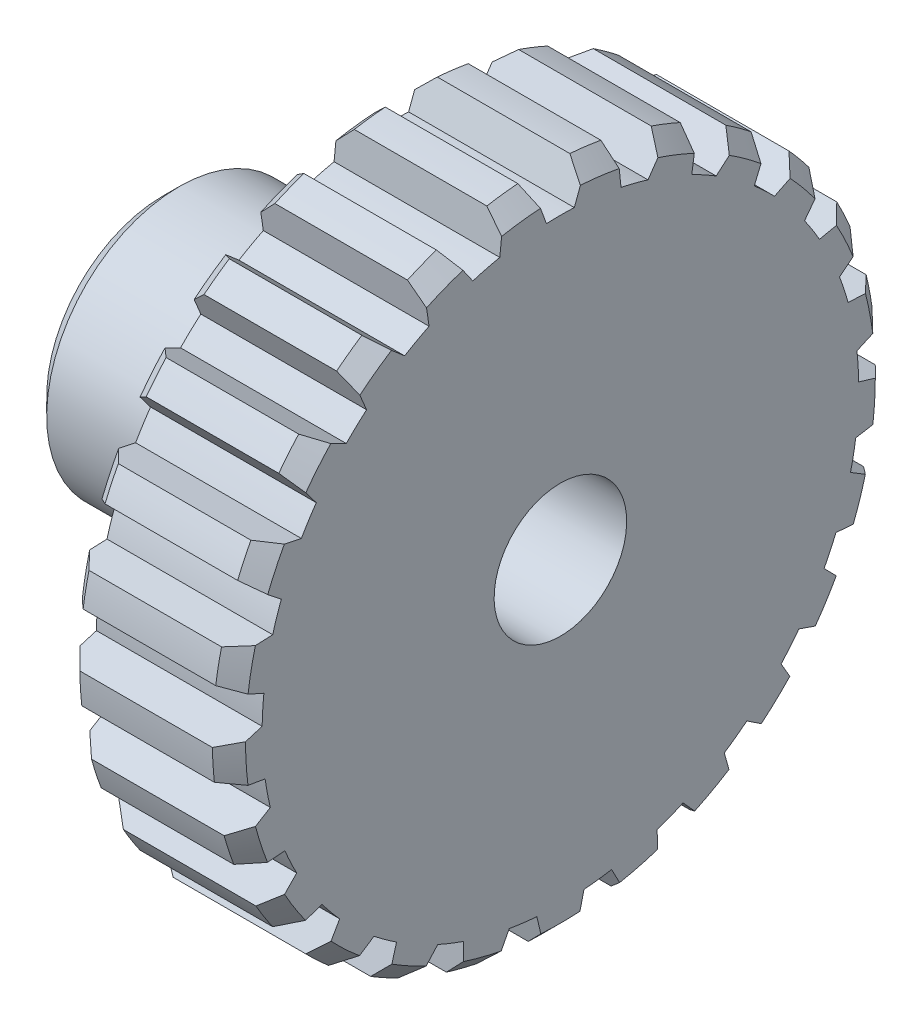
from build123d import *

# Parameters (mm, degrees)
CHAMFER4_SIZE      = 0.5
CUT_EXTRUDE2_DEPTH = 10
SCALE3_SCALE       = 1.25


with BuildPart() as part:
    # Sketch1 → Revolve1 (revolve)
    with BuildSketch(Plane.XY):
        Polygon((0, 2), (-12, 2), (-12, 4), (-5, 4), (-5, 10), (0, 10), align=None)
    revolve(axis=Axis((0, 0, 0), (-1, 0, 0)))

    # Chamfer4
    chamfer4_edges = [part.edges().sort_by_distance(p)[0] for p in [
        (-12, -4, 0),
        (-5, -10, 0),
        (0, -10, 0),
    ]]
    chamfer(chamfer4_edges, length=CHAMFER4_SIZE)

    # Sketch3 → Cut-Extrude2 (cut)
    with BuildSketch(Plane(origin=(0, 0, 0), x_dir=(0, 0, -1), z_dir=(1, 0, 0))):
        with BuildLine():
            Line((-0.785, 9.969141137), (-0.42, 8.990194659))
            ThreePointArc((-0.42, 8.990194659), (0, 9), (0.42, 8.990194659))
            Line((0.42, 8.990194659), (0.785, 9.969141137))
            Line((0.785, 9.969141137), (0.785, 10.77942288))
            ThreePointArc((0.785, 10.77942288), (0, 10.807968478), (-0.785, 10.77942288))
            Line((-0.785, 10.77942288), (-0.785, 9.969141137))
        make_face()
        with BuildLine():
            Line((1.920395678, 10.63598905), (1.718886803, 9.851163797))
            Line((1.718886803, 9.851163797), (1.828965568, 8.812200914))
            ThreePointArc((1.828965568, 8.812200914), (2.238208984, 8.71724845), (2.642575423, 8.603301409))
            Line((2.642575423, 8.603301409), (3.239562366, 9.460720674))
            Line((3.239562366, 9.460720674), (3.441071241, 10.245545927))
            ThreePointArc((3.441071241, 10.245545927), (2.687832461, 10.468416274), (1.920395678, 10.63598905))
        make_face()
        with BuildLine():
            Line((4.505125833, 9.824256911), (4.114769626, 9.114201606))
            Line((4.114769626, 9.114201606), (3.963010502, 8.080504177))
            ThreePointArc((3.963010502, 8.080504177), (4.335783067, 7.88676012), (4.699108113, 7.675831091))
            Line((4.699108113, 7.675831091), (5.490571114, 8.357848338))
            Line((5.490571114, 8.357848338), (5.880927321, 9.067903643))
            ThreePointArc((5.880927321, 9.067903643), (5.206778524, 9.471094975), (4.505125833, 9.824256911))
        make_face()
        with BuildLine():
            Line((6.806782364, 8.39523058), (6.252106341, 7.804560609))
            Line((6.252106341, 7.804560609), (5.848044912, 6.841079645))
            ThreePointArc((5.848044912, 6.841079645), (6.160923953, 6.560717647), (6.460378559, 6.266060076))
            Line((6.460378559, 6.266060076), (7.396587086, 6.729821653))
            Line((7.396587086, 6.729821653), (7.951263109, 7.320491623))
            ThreePointArc((7.951263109, 7.320491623), (7.398563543, 7.878669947), (6.806782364, 8.39523058))
        make_face()
        with BuildLine():
            Line((8.680743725, 6.438701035), (7.996600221, 6.004530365))
            Line((7.996600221, 6.004530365), (7.365625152, 5.171804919))
            ThreePointArc((7.365625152, 5.171804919), (7.59895133, 4.822441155), (7.81571966, 4.462569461))
            Line((7.81571966, 4.462569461), (8.837848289, 4.678935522))
            Line((8.837848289, 4.678935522), (9.521991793, 5.113106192))
            ThreePointArc((9.521991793, 5.113106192), (9.125469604, 5.79119911), (8.680743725, 6.438701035))
        make_face()
        with BuildLine():
            Line((10.009262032, 4.077604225), (9.238638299, 3.827213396))
            Line((9.238638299, 3.827213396), (8.420396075, 3.177566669))
            ThreePointArc((8.420396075, 3.177566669), (8.559508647, 2.781152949), (8.67997035, 2.378679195))
            Line((8.67997035, 2.378679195), (9.72379498, 2.334054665))
            Line((9.72379498, 2.334054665), (10.494418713, 2.584445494))
            ThreePointArc((10.494418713, 2.584445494), (10.278988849, 3.339845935), (10.009262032, 4.077604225))
        make_face()
        with BuildLine():
            Line((10.708861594, 1.460296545), (9.900178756, 1.409418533))
            Line((9.900178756, 1.409418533), (8.946082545, 0.983670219))
            ThreePointArc((8.946082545, 0.983670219), (8.982240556, 0.565114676), (8.998826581, 0.145327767))
            Line((8.998826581, 0.145327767), (9.998759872, -0.157483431))
            Line((9.998759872, -0.157483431), (10.807442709, -0.106605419))
            ThreePointArc((10.807442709, -0.106605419), (10.786641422, 0.678637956), (10.708861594, 1.460296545))
        make_face()
        with BuildLine():
            Line((10.735583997, -1.248766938), (9.939654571, -1.09693528))
            Line((9.939654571, -1.09693528), (8.909653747, -1.272033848))
            ThreePointArc((8.909653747, -1.272033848), (8.840585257, -1.686431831), (8.752253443, -2.097155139))
            Line((8.752253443, -2.097155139), (9.645465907, -2.639126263))
            Line((9.645465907, -2.639126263), (10.441395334, -2.790957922))
            ThreePointArc((10.441395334, -2.790957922), (10.616529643, -2.025211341), (10.735583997, -1.248766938))
        make_face()
        with BuildLine():
            Line((10.087750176, -3.879365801), (9.354585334, -3.534364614))
            Line((9.354585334, -3.534364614), (8.313398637, -3.447811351))
            ThreePointArc((8.313398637, -3.447811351), (8.143443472, -3.832013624), (7.955744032, -4.207866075))
            Line((7.955744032, -4.207866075), (8.686111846, -4.954943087))
            Line((8.686111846, -4.954943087), (9.419276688, -5.299944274))
            ThreePointArc((9.419276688, -5.299944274), (9.779342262, -4.601809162), (10.087750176, -3.879365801))
        make_face()
        with BuildLine():
            Line((8.806065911, -6.266209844), (8.181733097, -5.749716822))
            Line((8.181733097, -5.749716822), (7.194782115, -5.406950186))
            ThreePointArc((7.194782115, -5.406950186), (6.934619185, -5.736815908), (6.659345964, -6.05418131))
            Line((6.659345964, -6.05418131), (7.180977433, -6.959422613))
            Line((7.180977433, -6.959422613), (7.805310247, -7.475915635))
            ThreePointArc((7.805310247, -7.475915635), (8.32768284, -6.889258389), (8.806065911, -6.266209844))
        make_face()
        with BuildLine():
            Line((6.971064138, -8.259324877), (6.494792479, -7.603793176))
            Line((6.494792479, -7.603793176), (5.624090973, -7.026350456))
            ThreePointArc((5.624090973, -7.026350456), (5.290067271, -7.281152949), (4.944516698, -7.520090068))
            Line((4.944516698, -7.520090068), (5.224635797, -8.526616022))
            Line((5.224635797, -8.526616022), (5.700907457, -9.182147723))
            ThreePointArc((5.700907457, -9.182147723), (6.352764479, -8.743830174), (6.971064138, -8.259324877))
        make_face()
        with BuildLine():
            Line((4.698044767, -9.733476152), (4.399760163, -8.980095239))
            Line((4.399760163, -8.980095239), (3.700017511, -8.204259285))
            ThreePointArc((3.700017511, -8.204259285), (3.313120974, -8.367988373), (2.919005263, -8.513483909))
            Line((2.919005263, -8.513483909), (2.94001108, -9.558050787))
            Line((2.94001108, -9.558050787), (3.238295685, -10.311431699))
            ThreePointArc((3.238295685, -10.311431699), (3.978678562, -10.048994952), (4.698044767, -9.733476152))
        make_face()
        with BuildLine():
            Line((2.129829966, -10.596037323), (2.028274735, -9.792144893))
            Line((2.028274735, -9.792144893), (1.543458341, -8.86666433))
            ThreePointArc((1.543458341, -8.86666433), (1.127999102, -8.929032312), (0.710081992, -8.971944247))
            Line((0.710081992, -8.971944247), (0.470654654, -9.988918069))
            Line((0.470654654, -9.988918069), (0.572209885, -10.7928105))
            ThreePointArc((0.572209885, -10.7928105), (1.354597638, -10.722744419), (2.129829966, -10.596037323))
        make_face()
        with BuildLine():
            Line((-0.572209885, -10.7928105), (-0.470654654, -9.988918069))
            Line((-0.470654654, -9.988918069), (-0.710081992, -8.971944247))
            ThreePointArc((-0.710081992, -8.971944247), (-1.127999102, -8.929032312), (-1.543458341, -8.86666433))
            Line((-1.543458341, -8.86666433), (-2.028274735, -9.792144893))
            Line((-2.028274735, -9.792144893), (-2.129829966, -10.596037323))
            ThreePointArc((-2.129829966, -10.596037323), (-1.354597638, -10.722744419), (-0.572209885, -10.7928105))
        make_face()
        with BuildLine():
            Line((-3.238295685, -10.311431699), (-2.94001108, -9.558050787))
            Line((-2.94001108, -9.558050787), (-2.919005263, -8.513483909))
            ThreePointArc((-2.919005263, -8.513483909), (-3.313120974, -8.367988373), (-3.700017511, -8.204259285))
            Line((-3.700017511, -8.204259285), (-4.399760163, -8.980095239))
            Line((-4.399760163, -8.980095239), (-4.698044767, -9.733476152))
            ThreePointArc((-4.698044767, -9.733476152), (-3.978678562, -10.048994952), (-3.238295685, -10.311431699))
        make_face()
        with BuildLine():
            Line((-5.700907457, -9.182147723), (-5.224635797, -8.526616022))
            Line((-5.224635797, -8.526616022), (-4.944516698, -7.520090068))
            ThreePointArc((-4.944516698, -7.520090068), (-5.290067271, -7.281152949), (-5.624090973, -7.026350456))
            Line((-5.624090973, -7.026350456), (-6.494792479, -7.603793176))
            Line((-6.494792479, -7.603793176), (-6.971064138, -8.259324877))
            ThreePointArc((-6.971064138, -8.259324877), (-6.352764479, -8.743830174), (-5.700907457, -9.182147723))
        make_face()
        with BuildLine():
            Line((-7.805310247, -7.475915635), (-7.180977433, -6.959422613))
            Line((-7.180977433, -6.959422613), (-6.659345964, -6.05418131))
            ThreePointArc((-6.659345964, -6.05418131), (-6.934619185, -5.736815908), (-7.194782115, -5.406950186))
            Line((-7.194782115, -5.406950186), (-8.181733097, -5.749716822))
            Line((-8.181733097, -5.749716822), (-8.806065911, -6.266209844))
            ThreePointArc((-8.806065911, -6.266209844), (-8.32768284, -6.889258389), (-7.805310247, -7.475915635))
        make_face()
        with BuildLine():
            Line((-9.419276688, -5.299944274), (-8.686111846, -4.954943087))
            Line((-8.686111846, -4.954943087), (-7.955744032, -4.207866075))
            ThreePointArc((-7.955744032, -4.207866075), (-8.143443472, -3.832013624), (-8.313398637, -3.447811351))
            Line((-8.313398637, -3.447811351), (-9.354585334, -3.534364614))
            Line((-9.354585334, -3.534364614), (-10.087750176, -3.879365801))
            ThreePointArc((-10.087750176, -3.879365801), (-9.779342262, -4.601809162), (-9.419276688, -5.299944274))
        make_face()
        with BuildLine():
            Line((-10.441395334, -2.790957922), (-9.645465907, -2.639126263))
            Line((-9.645465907, -2.639126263), (-8.752253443, -2.097155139))
            ThreePointArc((-8.752253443, -2.097155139), (-8.840585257, -1.686431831), (-8.909653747, -1.272033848))
            Line((-8.909653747, -1.272033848), (-9.939654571, -1.09693528))
            Line((-9.939654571, -1.09693528), (-10.735583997, -1.248766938))
            ThreePointArc((-10.735583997, -1.248766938), (-10.616529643, -2.025211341), (-10.441395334, -2.790957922))
        make_face()
        with BuildLine():
            Line((-10.807442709, -0.106605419), (-9.998759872, -0.157483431))
            Line((-9.998759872, -0.157483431), (-8.998826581, 0.145327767))
            ThreePointArc((-8.998826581, 0.145327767), (-8.982240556, 0.565114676), (-8.946082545, 0.983670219))
            Line((-8.946082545, 0.983670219), (-9.900178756, 1.409418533))
            Line((-9.900178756, 1.409418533), (-10.708861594, 1.460296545))
            ThreePointArc((-10.708861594, 1.460296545), (-10.786641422, 0.678637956), (-10.807442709, -0.106605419))
        make_face()
        with BuildLine():
            Line((-10.494418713, 2.584445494), (-9.72379498, 2.334054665))
            Line((-9.72379498, 2.334054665), (-8.67997035, 2.378679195))
            ThreePointArc((-8.67997035, 2.378679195), (-8.559508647, 2.781152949), (-8.420396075, 3.177566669))
            Line((-8.420396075, 3.177566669), (-9.238638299, 3.827213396))
            Line((-9.238638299, 3.827213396), (-10.009262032, 4.077604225))
            ThreePointArc((-10.009262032, 4.077604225), (-10.278988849, 3.339845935), (-10.494418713, 2.584445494))
        make_face()
        with BuildLine():
            Line((-9.521991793, 5.113106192), (-8.837848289, 4.678935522))
            Line((-8.837848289, 4.678935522), (-7.81571966, 4.462569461))
            ThreePointArc((-7.81571966, 4.462569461), (-7.59895133, 4.822441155), (-7.365625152, 5.171804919))
            Line((-7.365625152, 5.171804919), (-7.996600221, 6.004530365))
            Line((-7.996600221, 6.004530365), (-8.680743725, 6.438701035))
            ThreePointArc((-8.680743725, 6.438701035), (-9.125469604, 5.79119911), (-9.521991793, 5.113106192))
        make_face()
        with BuildLine():
            Line((-7.951263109, 7.320491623), (-7.396587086, 6.729821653))
            Line((-7.396587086, 6.729821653), (-6.460378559, 6.266060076))
            ThreePointArc((-6.460378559, 6.266060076), (-6.160923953, 6.560717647), (-5.848044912, 6.841079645))
            Line((-5.848044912, 6.841079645), (-6.252106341, 7.804560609))
            Line((-6.252106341, 7.804560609), (-6.806782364, 8.39523058))
            ThreePointArc((-6.806782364, 8.39523058), (-7.398563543, 7.878669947), (-7.951263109, 7.320491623))
        make_face()
        with BuildLine():
            Line((-5.880927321, 9.067903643), (-5.490571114, 8.357848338))
            Line((-5.490571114, 8.357848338), (-4.699108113, 7.675831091))
            ThreePointArc((-4.699108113, 7.675831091), (-4.335783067, 7.88676012), (-3.963010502, 8.080504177))
            Line((-3.963010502, 8.080504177), (-4.114769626, 9.114201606))
            Line((-4.114769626, 9.114201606), (-4.505125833, 9.824256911))
            ThreePointArc((-4.505125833, 9.824256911), (-5.206778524, 9.471094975), (-5.880927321, 9.067903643))
        make_face()
        with BuildLine():
            Line((-3.441071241, 10.245545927), (-3.239562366, 9.460720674))
            Line((-3.239562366, 9.460720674), (-2.642575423, 8.603301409))
            ThreePointArc((-2.642575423, 8.603301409), (-2.238208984, 8.71724845), (-1.828965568, 8.812200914))
            Line((-1.828965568, 8.812200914), (-1.718886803, 9.851163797))
            Line((-1.718886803, 9.851163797), (-1.920395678, 10.63598905))
            ThreePointArc((-1.920395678, 10.63598905), (-2.687832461, 10.468416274), (-3.441071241, 10.245545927))
        make_face()
    extrude(amount=-CUT_EXTRUDE2_DEPTH, mode=Mode.SUBTRACT)


with BuildPart() as part_1:
    # Scale3: scaled about (0, 0, 0)
    add(part.part.scale(SCALE3_SCALE))


solid = part_1.part
